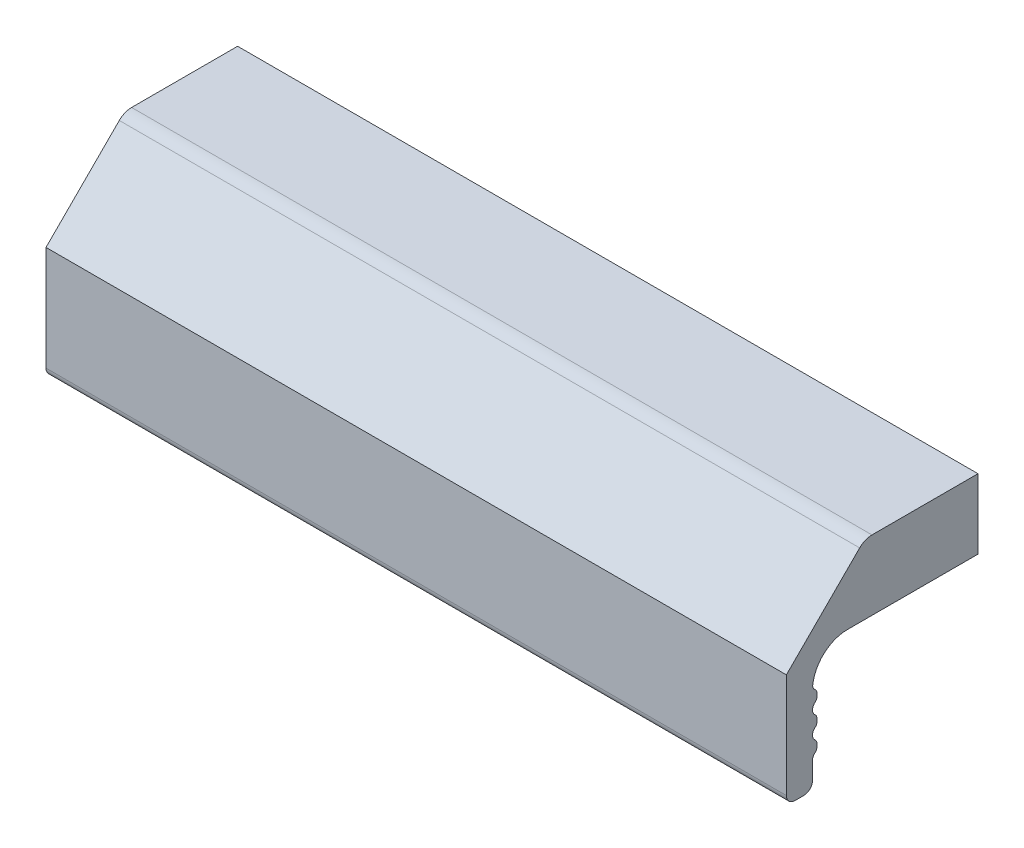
ISO-10303-21;
HEADER;
FILE_DESCRIPTION(('STEP AP214'),'2;1');
FILE_NAME('part.step','',(''),(''),'','','');
FILE_SCHEMA(('AUTOMOTIVE_DESIGN { 1 0 10303 214 1 1 1 1 }'));
ENDSEC;
DATA;
#1=APPLICATION_CONTEXT('core data for automotive mechanical design processes');
#2=APPLICATION_PROTOCOL_DEFINITION('international standard','automotive_design',2000,#1);
#3=PRODUCT_CONTEXT('',#1,'mechanical');
#4=PRODUCT('Part','Part','',(#3));
#5=PRODUCT_RELATED_PRODUCT_CATEGORY('part','',(#4));
#6=PRODUCT_DEFINITION_FORMATION('','',#4);
#7=PRODUCT_DEFINITION_CONTEXT('part definition',#1,'design');
#8=PRODUCT_DEFINITION('design','',#6,#7);
#9=PRODUCT_DEFINITION_SHAPE('','',#8);
#10=(LENGTH_UNIT() NAMED_UNIT(*) SI_UNIT(.MILLI.,.METRE.));
#11=(NAMED_UNIT(*) PLANE_ANGLE_UNIT() SI_UNIT($,.RADIAN.));
#12=(NAMED_UNIT(*) SI_UNIT($,.STERADIAN.) SOLID_ANGLE_UNIT());
#13=UNCERTAINTY_MEASURE_WITH_UNIT(LENGTH_MEASURE(1.E-05),#10,'distance_accuracy_value','');
#14=(GEOMETRIC_REPRESENTATION_CONTEXT(3) GLOBAL_UNCERTAINTY_ASSIGNED_CONTEXT((#13)) GLOBAL_UNIT_ASSIGNED_CONTEXT((#10,
#11,#12)) REPRESENTATION_CONTEXT('',''));
#15=CARTESIAN_POINT('',(0.,0.,0.));
#16=DIRECTION('',(0.,0.,1.));
#17=DIRECTION('',(1.,0.,0.));
#18=AXIS2_PLACEMENT_3D('',#15,#16,#17);
#19=CARTESIAN_POINT('',(77.5,-17.,22.));
#20=DIRECTION('',(0.,0.,1.));
#21=DIRECTION('',(1.,0.,0.));
#22=AXIS2_PLACEMENT_3D('',#19,#20,#21);
#23=PLANE('',#22);
#24=DIRECTION('',(-1.,0.,0.));
#25=VECTOR('',#24,1.);
#26=CARTESIAN_POINT('',(77.5,-17.,22.));
#27=LINE('',#26,#25);
#28=CARTESIAN_POINT('',(77.5,-17.,22.));
#29=VERTEX_POINT('',#28);
#30=CARTESIAN_POINT('',(-7.5,-17.,22.));
#31=VERTEX_POINT('',#30);
#32=EDGE_CURVE('E9',#29,#31,#27,.T.);
#33=ORIENTED_EDGE('',*,*,#32,.F.);
#34=DIRECTION('',(0.,1.,0.));
#35=VECTOR('',#34,1.);
#36=CARTESIAN_POINT('',(77.5,-17.,22.));
#37=LINE('',#36,#35);
#38=CARTESIAN_POINT('',(77.5,-5.,22.));
#39=VERTEX_POINT('',#38);
#40=EDGE_CURVE('E181',#29,#39,#37,.T.);
#41=ORIENTED_EDGE('',*,*,#40,.T.);
#42=DIRECTION('',(-1.,0.,0.));
#43=VECTOR('',#42,1.);
#44=CARTESIAN_POINT('',(77.5,-5.,22.));
#45=LINE('',#44,#43);
#46=CARTESIAN_POINT('',(-7.5,-5.,22.));
#47=VERTEX_POINT('',#46);
#48=EDGE_CURVE('E177',#39,#47,#45,.T.);
#49=ORIENTED_EDGE('',*,*,#48,.T.);
#50=DIRECTION('',(0.,1.,0.));
#51=VECTOR('',#50,1.);
#52=CARTESIAN_POINT('',(-7.5,-17.,22.));
#53=LINE('',#52,#51);
#54=EDGE_CURVE('E179',#31,#47,#53,.T.);
#55=ORIENTED_EDGE('',*,*,#54,.F.);
#56=EDGE_LOOP('',(#33,#41,#49,#55));
#57=FACE_BOUND('',#56,.T.);
#58=ADVANCED_FACE('F14',(#57),#23,.T.);
#59=CARTESIAN_POINT('',(77.5,-17.,21.));
#60=DIRECTION('',(-1.,0.,0.));
#61=DIRECTION('',(0.,0.,1.));
#62=AXIS2_PLACEMENT_3D('',#59,#60,#61);
#63=CYLINDRICAL_SURFACE('',#62,1.);
#64=DIRECTION('',(-1.,0.,0.));
#65=VECTOR('',#64,1.);
#66=CARTESIAN_POINT('',(77.5,-18.,21.));
#67=LINE('',#66,#65);
#68=CARTESIAN_POINT('',(77.5,-18.,21.));
#69=VERTEX_POINT('',#68);
#70=CARTESIAN_POINT('',(-7.5,-18.,21.));
#71=VERTEX_POINT('',#70);
#72=EDGE_CURVE('E22',#69,#71,#67,.T.);
#73=ORIENTED_EDGE('',*,*,#72,.F.);
#74=CARTESIAN_POINT('',(77.5,-17.,21.));
#75=DIRECTION('',(1.,0.,0.));
#76=DIRECTION('',(0.,0.,-1.));
#77=AXIS2_PLACEMENT_3D('',#74,#75,#76);
#78=CIRCLE('',#77,1.);
#79=EDGE_CURVE('E187',#29,#69,#78,.T.);
#80=ORIENTED_EDGE('',*,*,#79,.F.);
#81=ORIENTED_EDGE('',*,*,#32,.T.);
#82=CARTESIAN_POINT('',(-7.5,-17.,21.));
#83=DIRECTION('',(1.,0.,0.));
#84=DIRECTION('',(0.,0.,-1.));
#85=AXIS2_PLACEMENT_3D('',#82,#83,#84);
#86=CIRCLE('',#85,1.);
#87=EDGE_CURVE('E196',#31,#71,#86,.T.);
#88=ORIENTED_EDGE('',*,*,#87,.T.);
#89=EDGE_LOOP('',(#73,#80,#81,#88));
#90=FACE_BOUND('',#89,.T.);
#91=ADVANCED_FACE('F16',(#90),#63,.T.);
#92=CARTESIAN_POINT('',(77.5,-18.,20.));
#93=DIRECTION('',(0.,-1.,0.));
#94=DIRECTION('',(-1.,0.,0.));
#95=AXIS2_PLACEMENT_3D('',#92,#93,#94);
#96=PLANE('',#95);
#97=DIRECTION('',(-1.,0.,0.));
#98=VECTOR('',#97,1.);
#99=CARTESIAN_POINT('',(77.5,-18.,20.));
#100=LINE('',#99,#98);
#101=CARTESIAN_POINT('',(77.5,-18.,20.));
#102=VERTEX_POINT('',#101);
#103=CARTESIAN_POINT('',(-7.5,-18.,20.));
#104=VERTEX_POINT('',#103);
#105=EDGE_CURVE('E379',#102,#104,#100,.T.);
#106=ORIENTED_EDGE('',*,*,#105,.F.);
#107=DIRECTION('',(0.,0.,1.));
#108=VECTOR('',#107,1.);
#109=CARTESIAN_POINT('',(77.5,-18.,20.));
#110=LINE('',#109,#108);
#111=EDGE_CURVE('E334',#102,#69,#110,.T.);
#112=ORIENTED_EDGE('',*,*,#111,.T.);
#113=ORIENTED_EDGE('',*,*,#72,.T.);
#114=DIRECTION('',(0.,0.,1.));
#115=VECTOR('',#114,1.);
#116=CARTESIAN_POINT('',(-7.5,-18.,20.));
#117=LINE('',#116,#115);
#118=EDGE_CURVE('E265',#104,#71,#117,.T.);
#119=ORIENTED_EDGE('',*,*,#118,.F.);
#120=EDGE_LOOP('',(#106,#112,#113,#119));
#121=FACE_BOUND('',#120,.T.);
#122=ADVANCED_FACE('F382',(#121),#96,.T.);
#123=CARTESIAN_POINT('',(77.5,-17.,20.));
#124=DIRECTION('',(-1.,0.,0.));
#125=DIRECTION('',(0.,0.,1.));
#126=AXIS2_PLACEMENT_3D('',#123,#124,#125);
#127=CYLINDRICAL_SURFACE('',#126,1.);
#128=DIRECTION('',(-1.,0.,0.));
#129=VECTOR('',#128,1.);
#130=CARTESIAN_POINT('',(77.5,-17.,19.));
#131=LINE('',#130,#129);
#132=CARTESIAN_POINT('',(77.5,-17.,19.));
#133=VERTEX_POINT('',#132);
#134=CARTESIAN_POINT('',(-7.5,-17.,19.));
#135=VERTEX_POINT('',#134);
#136=EDGE_CURVE('E377',#133,#135,#131,.T.);
#137=ORIENTED_EDGE('',*,*,#136,.F.);
#138=CARTESIAN_POINT('',(77.5,-17.,20.));
#139=DIRECTION('',(1.,0.,0.));
#140=DIRECTION('',(0.,0.,-1.));
#141=AXIS2_PLACEMENT_3D('',#138,#139,#140);
#142=CIRCLE('',#141,1.);
#143=EDGE_CURVE('E331',#102,#133,#142,.T.);
#144=ORIENTED_EDGE('',*,*,#143,.F.);
#145=ORIENTED_EDGE('',*,*,#105,.T.);
#146=CARTESIAN_POINT('',(-7.5,-17.,20.));
#147=DIRECTION('',(1.,0.,0.));
#148=DIRECTION('',(0.,0.,-1.));
#149=AXIS2_PLACEMENT_3D('',#146,#147,#148);
#150=CIRCLE('',#149,1.);
#151=EDGE_CURVE('E262',#104,#135,#150,.T.);
#152=ORIENTED_EDGE('',*,*,#151,.T.);
#153=EDGE_LOOP('',(#137,#144,#145,#152));
#154=FACE_BOUND('',#153,.T.);
#155=ADVANCED_FACE('F468',(#154),#127,.T.);
#156=CARTESIAN_POINT('',(77.5,-17.,19.));
#157=DIRECTION('',(0.,-1.80411241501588E-13,1.));
#158=DIRECTION('',(0.,-1.,-1.80411241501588E-13));
#159=AXIS2_PLACEMENT_3D('',#156,#157,#158);
#160=PLANE('',#159);
#161=DIRECTION('',(-1.,0.,0.));
#162=VECTOR('',#161,1.);
#163=CARTESIAN_POINT('',(77.5,-15.,19.));
#164=LINE('',#163,#162);
#165=CARTESIAN_POINT('',(77.5,-15.,19.));
#166=VERTEX_POINT('',#165);
#167=CARTESIAN_POINT('',(-7.5,-15.,19.));
#168=VERTEX_POINT('',#167);
#169=EDGE_CURVE('E375',#166,#168,#164,.T.);
#170=ORIENTED_EDGE('',*,*,#169,.F.);
#171=DIRECTION('',(0.,1.,1.80411241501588E-13));
#172=VECTOR('',#171,1.);
#173=CARTESIAN_POINT('',(77.5,-17.,19.));
#174=LINE('',#173,#172);
#175=EDGE_CURVE('E328',#133,#166,#174,.T.);
#176=ORIENTED_EDGE('',*,*,#175,.F.);
#177=ORIENTED_EDGE('',*,*,#136,.T.);
#178=DIRECTION('',(0.,1.,1.80411241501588E-13));
#179=VECTOR('',#178,1.);
#180=CARTESIAN_POINT('',(-7.5,-17.,19.));
#181=LINE('',#180,#179);
#182=EDGE_CURVE('E259',#135,#168,#181,.T.);
#183=ORIENTED_EDGE('',*,*,#182,.T.);
#184=EDGE_LOOP('',(#170,#176,#177,#183));
#185=FACE_BOUND('',#184,.T.);
#186=ADVANCED_FACE('F464',(#185),#160,.F.);
#187=CARTESIAN_POINT('',(77.5,-15.,18.2));
#188=DIRECTION('',(-1.,0.,0.));
#189=DIRECTION('',(0.,0.,1.));
#190=AXIS2_PLACEMENT_3D('',#187,#188,#189);
#191=CYLINDRICAL_SURFACE('',#190,0.800000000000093);
#192=DIRECTION('',(-1.,0.,0.));
#193=VECTOR('',#192,1.);
#194=CARTESIAN_POINT('',(77.5,-14.3694184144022,18.6923076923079));
#195=LINE('',#194,#193);
#196=CARTESIAN_POINT('',(77.5,-14.3694184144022,18.6923076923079));
#197=VERTEX_POINT('',#196);
#198=CARTESIAN_POINT('',(-7.5,-14.3694184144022,18.6923076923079));
#199=VERTEX_POINT('',#198);
#200=EDGE_CURVE('E373',#197,#199,#195,.T.);
#201=ORIENTED_EDGE('',*,*,#200,.F.);
#202=CARTESIAN_POINT('',(77.5,-15.,18.2));
#203=DIRECTION('',(1.,0.,0.));
#204=DIRECTION('',(0.,0.,-1.));
#205=AXIS2_PLACEMENT_3D('',#202,#203,#204);
#206=CIRCLE('',#205,0.800000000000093);
#207=EDGE_CURVE('E325',#197,#166,#206,.T.);
#208=ORIENTED_EDGE('',*,*,#207,.T.);
#209=ORIENTED_EDGE('',*,*,#169,.T.);
#210=CARTESIAN_POINT('',(-7.5,-15.,18.2));
#211=DIRECTION('',(1.,0.,0.));
#212=DIRECTION('',(0.,0.,-1.));
#213=AXIS2_PLACEMENT_3D('',#210,#211,#212);
#214=CIRCLE('',#213,0.800000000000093);
#215=EDGE_CURVE('E256',#199,#168,#214,.T.);
#216=ORIENTED_EDGE('',*,*,#215,.F.);
#217=EDGE_LOOP('',(#201,#208,#209,#216));
#218=FACE_BOUND('',#217,.T.);
#219=ADVANCED_FACE('F462',(#218),#191,.F.);
#220=CARTESIAN_POINT('',(77.5,-13.9753049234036,19.));
#221=DIRECTION('',(-1.,0.,0.));
#222=DIRECTION('',(0.,0.,1.));
#223=AXIS2_PLACEMENT_3D('',#220,#221,#222);
#224=CYLINDRICAL_SURFACE('',#223,0.5);
#225=DIRECTION('',(-1.,0.,0.));
#226=VECTOR('',#225,1.);
#227=CARTESIAN_POINT('',(77.5,-13.9753049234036,18.5));
#228=LINE('',#227,#226);
#229=CARTESIAN_POINT('',(77.5,-13.9753049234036,18.5));
#230=VERTEX_POINT('',#229);
#231=CARTESIAN_POINT('',(-7.5,-13.9753049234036,18.5));
#232=VERTEX_POINT('',#231);
#233=EDGE_CURVE('E371',#230,#232,#228,.T.);
#234=ORIENTED_EDGE('',*,*,#233,.F.);
#235=CARTESIAN_POINT('',(77.5,-13.9753049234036,19.));
#236=DIRECTION('',(1.,0.,0.));
#237=DIRECTION('',(0.,0.,-1.));
#238=AXIS2_PLACEMENT_3D('',#235,#236,#237);
#239=CIRCLE('',#238,0.5);
#240=EDGE_CURVE('E322',#197,#230,#239,.T.);
#241=ORIENTED_EDGE('',*,*,#240,.F.);
#242=ORIENTED_EDGE('',*,*,#200,.T.);
#243=CARTESIAN_POINT('',(-7.5,-13.9753049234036,19.));
#244=DIRECTION('',(1.,0.,0.));
#245=DIRECTION('',(0.,0.,-1.));
#246=AXIS2_PLACEMENT_3D('',#243,#244,#245);
#247=CIRCLE('',#246,0.5);
#248=EDGE_CURVE('E253',#199,#232,#247,.T.);
#249=ORIENTED_EDGE('',*,*,#248,.T.);
#250=EDGE_LOOP('',(#234,#241,#242,#249));
#251=FACE_BOUND('',#250,.T.);
#252=ADVANCED_FACE('F458',(#251),#224,.T.);
#253=CARTESIAN_POINT('',(77.5,-13.9753049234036,18.5));
#254=DIRECTION('',(0.,0.,1.));
#255=DIRECTION('',(1.,0.,0.));
#256=AXIS2_PLACEMENT_3D('',#253,#254,#255);
#257=PLANE('',#256);
#258=DIRECTION('',(-1.,0.,0.));
#259=VECTOR('',#258,1.);
#260=CARTESIAN_POINT('',(77.5,-13.5246950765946,18.5));
#261=LINE('',#260,#259);
#262=CARTESIAN_POINT('',(77.5,-13.5246950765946,18.5));
#263=VERTEX_POINT('',#262);
#264=CARTESIAN_POINT('',(-7.5,-13.5246950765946,18.5));
#265=VERTEX_POINT('',#264);
#266=EDGE_CURVE('E369',#263,#265,#261,.T.);
#267=ORIENTED_EDGE('',*,*,#266,.F.);
#268=DIRECTION('',(0.,1.,0.));
#269=VECTOR('',#268,1.);
#270=CARTESIAN_POINT('',(77.5,-13.9753049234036,18.5));
#271=LINE('',#270,#269);
#272=EDGE_CURVE('E319',#230,#263,#271,.T.);
#273=ORIENTED_EDGE('',*,*,#272,.F.);
#274=ORIENTED_EDGE('',*,*,#233,.T.);
#275=DIRECTION('',(0.,1.,0.));
#276=VECTOR('',#275,1.);
#277=CARTESIAN_POINT('',(-7.5,-13.9753049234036,18.5));
#278=LINE('',#277,#276);
#279=EDGE_CURVE('E250',#232,#265,#278,.T.);
#280=ORIENTED_EDGE('',*,*,#279,.T.);
#281=EDGE_LOOP('',(#267,#273,#274,#280));
#282=FACE_BOUND('',#281,.T.);
#283=ADVANCED_FACE('F454',(#282),#257,.F.);
#284=CARTESIAN_POINT('',(77.5,-13.5246950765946,19.));
#285=DIRECTION('',(-1.,0.,0.));
#286=DIRECTION('',(0.,0.,1.));
#287=AXIS2_PLACEMENT_3D('',#284,#285,#286);
#288=CYLINDRICAL_SURFACE('',#287,0.499999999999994);
#289=DIRECTION('',(-1.,0.,0.));
#290=VECTOR('',#289,1.);
#291=CARTESIAN_POINT('',(77.5,-13.1305815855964,18.6923076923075));
#292=LINE('',#291,#290);
#293=CARTESIAN_POINT('',(77.5,-13.1305815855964,18.6923076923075));
#294=VERTEX_POINT('',#293);
#295=CARTESIAN_POINT('',(-7.5,-13.1305815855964,18.6923076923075));
#296=VERTEX_POINT('',#295);
#297=EDGE_CURVE('E367',#294,#296,#292,.T.);
#298=ORIENTED_EDGE('',*,*,#297,.F.);
#299=CARTESIAN_POINT('',(77.5,-13.5246950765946,19.));
#300=DIRECTION('',(1.,0.,0.));
#301=DIRECTION('',(0.,0.,-1.));
#302=AXIS2_PLACEMENT_3D('',#299,#300,#301);
#303=CIRCLE('',#302,0.499999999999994);
#304=EDGE_CURVE('E316',#263,#294,#303,.T.);
#305=ORIENTED_EDGE('',*,*,#304,.F.);
#306=ORIENTED_EDGE('',*,*,#266,.T.);
#307=CARTESIAN_POINT('',(-7.5,-13.5246950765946,19.));
#308=DIRECTION('',(1.,0.,0.));
#309=DIRECTION('',(0.,0.,-1.));
#310=AXIS2_PLACEMENT_3D('',#307,#308,#309);
#311=CIRCLE('',#310,0.499999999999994);
#312=EDGE_CURVE('E247',#265,#296,#311,.T.);
#313=ORIENTED_EDGE('',*,*,#312,.T.);
#314=EDGE_LOOP('',(#298,#305,#306,#313));
#315=FACE_BOUND('',#314,.T.);
#316=ADVANCED_FACE('F450',(#315),#288,.T.);
#317=CARTESIAN_POINT('',(77.5,-12.5,18.2));
#318=DIRECTION('',(-1.,0.,0.));
#319=DIRECTION('',(0.,0.,1.));
#320=AXIS2_PLACEMENT_3D('',#317,#318,#319);
#321=CYLINDRICAL_SURFACE('',#320,0.799999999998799);
#322=DIRECTION('',(-1.,0.,0.));
#323=VECTOR('',#322,1.);
#324=CARTESIAN_POINT('',(77.5,-11.8694184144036,18.6923076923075));
#325=LINE('',#324,#323);
#326=CARTESIAN_POINT('',(77.5,-11.8694184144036,18.6923076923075));
#327=VERTEX_POINT('',#326);
#328=CARTESIAN_POINT('',(-7.5,-11.8694184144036,18.6923076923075));
#329=VERTEX_POINT('',#328);
#330=EDGE_CURVE('E365',#327,#329,#325,.T.);
#331=ORIENTED_EDGE('',*,*,#330,.F.);
#332=CARTESIAN_POINT('',(77.5,-12.5,18.2));
#333=DIRECTION('',(1.,0.,0.));
#334=DIRECTION('',(0.,0.,-1.));
#335=AXIS2_PLACEMENT_3D('',#332,#333,#334);
#336=CIRCLE('',#335,0.799999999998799);
#337=EDGE_CURVE('E313',#327,#294,#336,.T.);
#338=ORIENTED_EDGE('',*,*,#337,.T.);
#339=ORIENTED_EDGE('',*,*,#297,.T.);
#340=CARTESIAN_POINT('',(-7.5,-12.5,18.2));
#341=DIRECTION('',(1.,0.,0.));
#342=DIRECTION('',(0.,0.,-1.));
#343=AXIS2_PLACEMENT_3D('',#340,#341,#342);
#344=CIRCLE('',#343,0.799999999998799);
#345=EDGE_CURVE('E244',#329,#296,#344,.T.);
#346=ORIENTED_EDGE('',*,*,#345,.F.);
#347=EDGE_LOOP('',(#331,#338,#339,#346));
#348=FACE_BOUND('',#347,.T.);
#349=ADVANCED_FACE('F446',(#348),#321,.F.);
#350=CARTESIAN_POINT('',(77.5,-11.4753049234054,19.));
#351=DIRECTION('',(-1.,0.,0.));
#352=DIRECTION('',(0.,0.,1.));
#353=AXIS2_PLACEMENT_3D('',#350,#351,#352);
#354=CYLINDRICAL_SURFACE('',#353,0.5);
#355=DIRECTION('',(-1.,0.,0.));
#356=VECTOR('',#355,1.);
#357=CARTESIAN_POINT('',(77.5,-11.4753049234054,18.5));
#358=LINE('',#357,#356);
#359=CARTESIAN_POINT('',(77.5,-11.4753049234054,18.5));
#360=VERTEX_POINT('',#359);
#361=CARTESIAN_POINT('',(-7.5,-11.4753049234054,18.5));
#362=VERTEX_POINT('',#361);
#363=EDGE_CURVE('E363',#360,#362,#358,.T.);
#364=ORIENTED_EDGE('',*,*,#363,.F.);
#365=CARTESIAN_POINT('',(77.5,-11.4753049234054,19.));
#366=DIRECTION('',(1.,0.,0.));
#367=DIRECTION('',(0.,0.,-1.));
#368=AXIS2_PLACEMENT_3D('',#365,#366,#367);
#369=CIRCLE('',#368,0.5);
#370=EDGE_CURVE('E310',#327,#360,#369,.T.);
#371=ORIENTED_EDGE('',*,*,#370,.F.);
#372=ORIENTED_EDGE('',*,*,#330,.T.);
#373=CARTESIAN_POINT('',(-7.5,-11.4753049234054,19.));
#374=DIRECTION('',(1.,0.,0.));
#375=DIRECTION('',(0.,0.,-1.));
#376=AXIS2_PLACEMENT_3D('',#373,#374,#375);
#377=CIRCLE('',#376,0.5);
#378=EDGE_CURVE('E241',#329,#362,#377,.T.);
#379=ORIENTED_EDGE('',*,*,#378,.T.);
#380=EDGE_LOOP('',(#364,#371,#372,#379));
#381=FACE_BOUND('',#380,.T.);
#382=ADVANCED_FACE('F442',(#381),#354,.T.);
#383=CARTESIAN_POINT('',(77.5,-11.4753049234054,18.5));
#384=DIRECTION('',(0.,0.,1.));
#385=DIRECTION('',(1.,0.,0.));
#386=AXIS2_PLACEMENT_3D('',#383,#384,#385);
#387=PLANE('',#386);
#388=DIRECTION('',(-1.,0.,0.));
#389=VECTOR('',#388,1.);
#390=CARTESIAN_POINT('',(77.5,-11.0246950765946,18.5));
#391=LINE('',#390,#389);
#392=CARTESIAN_POINT('',(77.5,-11.0246950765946,18.5));
#393=VERTEX_POINT('',#392);
#394=CARTESIAN_POINT('',(-7.5,-11.0246950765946,18.5));
#395=VERTEX_POINT('',#394);
#396=EDGE_CURVE('E361',#393,#395,#391,.T.);
#397=ORIENTED_EDGE('',*,*,#396,.F.);
#398=DIRECTION('',(0.,1.,0.));
#399=VECTOR('',#398,1.);
#400=CARTESIAN_POINT('',(77.5,-11.4753049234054,18.5));
#401=LINE('',#400,#399);
#402=EDGE_CURVE('E307',#360,#393,#401,.T.);
#403=ORIENTED_EDGE('',*,*,#402,.F.);
#404=ORIENTED_EDGE('',*,*,#363,.T.);
#405=DIRECTION('',(0.,1.,0.));
#406=VECTOR('',#405,1.);
#407=CARTESIAN_POINT('',(-7.5,-11.4753049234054,18.5));
#408=LINE('',#407,#406);
#409=EDGE_CURVE('E238',#362,#395,#408,.T.);
#410=ORIENTED_EDGE('',*,*,#409,.T.);
#411=EDGE_LOOP('',(#397,#403,#404,#410));
#412=FACE_BOUND('',#411,.T.);
#413=ADVANCED_FACE('F438',(#412),#387,.F.);
#414=CARTESIAN_POINT('',(77.5,-11.0246950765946,19.));
#415=DIRECTION('',(-1.,0.,0.));
#416=DIRECTION('',(0.,0.,1.));
#417=AXIS2_PLACEMENT_3D('',#414,#415,#416);
#418=CYLINDRICAL_SURFACE('',#417,0.499999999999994);
#419=DIRECTION('',(-1.,0.,0.));
#420=VECTOR('',#419,1.);
#421=CARTESIAN_POINT('',(77.5,-10.630581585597,18.692307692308));
#422=LINE('',#421,#420);
#423=CARTESIAN_POINT('',(77.5,-10.630581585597,18.692307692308));
#424=VERTEX_POINT('',#423);
#425=CARTESIAN_POINT('',(-7.5,-10.630581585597,18.692307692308));
#426=VERTEX_POINT('',#425);
#427=EDGE_CURVE('E359',#424,#426,#422,.T.);
#428=ORIENTED_EDGE('',*,*,#427,.F.);
#429=CARTESIAN_POINT('',(77.5,-11.0246950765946,19.));
#430=DIRECTION('',(1.,0.,0.));
#431=DIRECTION('',(0.,0.,-1.));
#432=AXIS2_PLACEMENT_3D('',#429,#430,#431);
#433=CIRCLE('',#432,0.499999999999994);
#434=EDGE_CURVE('E304',#393,#424,#433,.T.);
#435=ORIENTED_EDGE('',*,*,#434,.F.);
#436=ORIENTED_EDGE('',*,*,#396,.T.);
#437=CARTESIAN_POINT('',(-7.5,-11.0246950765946,19.));
#438=DIRECTION('',(1.,0.,0.));
#439=DIRECTION('',(0.,0.,-1.));
#440=AXIS2_PLACEMENT_3D('',#437,#438,#439);
#441=CIRCLE('',#440,0.499999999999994);
#442=EDGE_CURVE('E235',#395,#426,#441,.T.);
#443=ORIENTED_EDGE('',*,*,#442,.T.);
#444=EDGE_LOOP('',(#428,#435,#436,#443));
#445=FACE_BOUND('',#444,.T.);
#446=ADVANCED_FACE('F434',(#445),#418,.T.);
#447=CARTESIAN_POINT('',(77.5,-10.,18.2));
#448=DIRECTION('',(-1.,0.,0.));
#449=DIRECTION('',(0.,0.,1.));
#450=AXIS2_PLACEMENT_3D('',#447,#448,#449);
#451=CYLINDRICAL_SURFACE('',#450,0.799999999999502);
#452=DIRECTION('',(-1.,0.,0.));
#453=VECTOR('',#452,1.);
#454=CARTESIAN_POINT('',(77.5,-9.36941841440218,18.6923076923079));
#455=LINE('',#454,#453);
#456=CARTESIAN_POINT('',(77.5,-9.36941841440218,18.6923076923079));
#457=VERTEX_POINT('',#456);
#458=CARTESIAN_POINT('',(-7.5,-9.36941841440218,18.6923076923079));
#459=VERTEX_POINT('',#458);
#460=EDGE_CURVE('E357',#457,#459,#455,.T.);
#461=ORIENTED_EDGE('',*,*,#460,.F.);
#462=CARTESIAN_POINT('',(77.5,-10.,18.2));
#463=DIRECTION('',(1.,0.,0.));
#464=DIRECTION('',(0.,0.,-1.));
#465=AXIS2_PLACEMENT_3D('',#462,#463,#464);
#466=CIRCLE('',#465,0.799999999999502);
#467=EDGE_CURVE('E301',#457,#424,#466,.T.);
#468=ORIENTED_EDGE('',*,*,#467,.T.);
#469=ORIENTED_EDGE('',*,*,#427,.T.);
#470=CARTESIAN_POINT('',(-7.5,-10.,18.2));
#471=DIRECTION('',(1.,0.,0.));
#472=DIRECTION('',(0.,0.,-1.));
#473=AXIS2_PLACEMENT_3D('',#470,#471,#472);
#474=CIRCLE('',#473,0.799999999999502);
#475=EDGE_CURVE('E232',#459,#426,#474,.T.);
#476=ORIENTED_EDGE('',*,*,#475,.F.);
#477=EDGE_LOOP('',(#461,#468,#469,#476));
#478=FACE_BOUND('',#477,.T.);
#479=ADVANCED_FACE('F430',(#478),#451,.F.);
#480=CARTESIAN_POINT('',(77.5,-8.97530492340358,19.));
#481=DIRECTION('',(-1.,0.,0.));
#482=DIRECTION('',(0.,0.,1.));
#483=AXIS2_PLACEMENT_3D('',#480,#481,#482);
#484=CYLINDRICAL_SURFACE('',#483,0.5);
#485=DIRECTION('',(-1.,0.,0.));
#486=VECTOR('',#485,1.);
#487=CARTESIAN_POINT('',(77.5,-8.97530492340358,18.5));
#488=LINE('',#487,#486);
#489=CARTESIAN_POINT('',(77.5,-8.97530492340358,18.5));
#490=VERTEX_POINT('',#489);
#491=CARTESIAN_POINT('',(-7.5,-8.97530492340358,18.5));
#492=VERTEX_POINT('',#491);
#493=EDGE_CURVE('E355',#490,#492,#488,.T.);
#494=ORIENTED_EDGE('',*,*,#493,.F.);
#495=CARTESIAN_POINT('',(77.5,-8.97530492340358,19.));
#496=DIRECTION('',(1.,0.,0.));
#497=DIRECTION('',(0.,0.,-1.));
#498=AXIS2_PLACEMENT_3D('',#495,#496,#497);
#499=CIRCLE('',#498,0.5);
#500=EDGE_CURVE('E298',#457,#490,#499,.T.);
#501=ORIENTED_EDGE('',*,*,#500,.F.);
#502=ORIENTED_EDGE('',*,*,#460,.T.);
#503=CARTESIAN_POINT('',(-7.5,-8.97530492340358,19.));
#504=DIRECTION('',(1.,0.,0.));
#505=DIRECTION('',(0.,0.,-1.));
#506=AXIS2_PLACEMENT_3D('',#503,#504,#505);
#507=CIRCLE('',#506,0.5);
#508=EDGE_CURVE('E229',#459,#492,#507,.T.);
#509=ORIENTED_EDGE('',*,*,#508,.T.);
#510=EDGE_LOOP('',(#494,#501,#502,#509));
#511=FACE_BOUND('',#510,.T.);
#512=ADVANCED_FACE('F426',(#511),#484,.T.);
#513=CARTESIAN_POINT('',(77.5,-8.97530492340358,18.5));
#514=DIRECTION('',(0.,0.,1.));
#515=DIRECTION('',(1.,0.,0.));
#516=AXIS2_PLACEMENT_3D('',#513,#514,#515);
#517=PLANE('',#516);
#518=DIRECTION('',(-1.,0.,0.));
#519=VECTOR('',#518,1.);
#520=CARTESIAN_POINT('',(77.5,-8.52469507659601,18.5));
#521=LINE('',#520,#519);
#522=CARTESIAN_POINT('',(77.5,-8.52469507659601,18.5));
#523=VERTEX_POINT('',#522);
#524=CARTESIAN_POINT('',(-7.5,-8.52469507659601,18.5));
#525=VERTEX_POINT('',#524);
#526=EDGE_CURVE('E353',#523,#525,#521,.T.);
#527=ORIENTED_EDGE('',*,*,#526,.F.);
#528=DIRECTION('',(0.,1.,0.));
#529=VECTOR('',#528,1.);
#530=CARTESIAN_POINT('',(77.5,-8.97530492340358,18.5));
#531=LINE('',#530,#529);
#532=EDGE_CURVE('E295',#490,#523,#531,.T.);
#533=ORIENTED_EDGE('',*,*,#532,.F.);
#534=ORIENTED_EDGE('',*,*,#493,.T.);
#535=DIRECTION('',(0.,1.,0.));
#536=VECTOR('',#535,1.);
#537=CARTESIAN_POINT('',(-7.5,-8.97530492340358,18.5));
#538=LINE('',#537,#536);
#539=EDGE_CURVE('E226',#492,#525,#538,.T.);
#540=ORIENTED_EDGE('',*,*,#539,.T.);
#541=EDGE_LOOP('',(#527,#533,#534,#540));
#542=FACE_BOUND('',#541,.T.);
#543=ADVANCED_FACE('F422',(#542),#517,.F.);
#544=CARTESIAN_POINT('',(77.5,-8.52469507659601,19.));
#545=DIRECTION('',(-1.,0.,0.));
#546=DIRECTION('',(0.,0.,1.));
#547=AXIS2_PLACEMENT_3D('',#544,#545,#546);
#548=CYLINDRICAL_SURFACE('',#547,0.5);
#549=DIRECTION('',(-1.,0.,0.));
#550=VECTOR('',#549,1.);
#551=CARTESIAN_POINT('',(77.5,-8.1305815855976,18.6923076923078));
#552=LINE('',#551,#550);
#553=CARTESIAN_POINT('',(77.5,-8.1305815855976,18.6923076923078));
#554=VERTEX_POINT('',#553);
#555=CARTESIAN_POINT('',(-7.5,-8.1305815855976,18.6923076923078));
#556=VERTEX_POINT('',#555);
#557=EDGE_CURVE('E351',#554,#556,#552,.T.);
#558=ORIENTED_EDGE('',*,*,#557,.F.);
#559=CARTESIAN_POINT('',(77.5,-8.52469507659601,19.));
#560=DIRECTION('',(1.,0.,0.));
#561=DIRECTION('',(0.,0.,-1.));
#562=AXIS2_PLACEMENT_3D('',#559,#560,#561);
#563=CIRCLE('',#562,0.5);
#564=EDGE_CURVE('E292',#523,#554,#563,.T.);
#565=ORIENTED_EDGE('',*,*,#564,.F.);
#566=ORIENTED_EDGE('',*,*,#526,.T.);
#567=CARTESIAN_POINT('',(-7.5,-8.52469507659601,19.));
#568=DIRECTION('',(1.,0.,0.));
#569=DIRECTION('',(0.,0.,-1.));
#570=AXIS2_PLACEMENT_3D('',#567,#568,#569);
#571=CIRCLE('',#570,0.5);
#572=EDGE_CURVE('E223',#525,#556,#571,.T.);
#573=ORIENTED_EDGE('',*,*,#572,.T.);
#574=EDGE_LOOP('',(#558,#565,#566,#573));
#575=FACE_BOUND('',#574,.T.);
#576=ADVANCED_FACE('F418',(#575),#548,.T.);
#577=CARTESIAN_POINT('',(77.5,-7.5,18.2));
#578=DIRECTION('',(-1.,0.,0.));
#579=DIRECTION('',(0.,0.,1.));
#580=AXIS2_PLACEMENT_3D('',#577,#578,#579);
#581=CYLINDRICAL_SURFACE('',#580,0.799999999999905);
#582=DIRECTION('',(-1.,0.,0.));
#583=VECTOR('',#582,1.);
#584=CARTESIAN_POINT('',(77.5,-7.7980536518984,18.9424042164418));
#585=LINE('',#584,#583);
#586=CARTESIAN_POINT('',(77.5,-7.7980536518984,18.9424042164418));
#587=VERTEX_POINT('',#586);
#588=CARTESIAN_POINT('',(-7.5,-7.7980536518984,18.9424042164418));
#589=VERTEX_POINT('',#588);
#590=EDGE_CURVE('E349',#587,#589,#585,.T.);
#591=ORIENTED_EDGE('',*,*,#590,.F.);
#592=CARTESIAN_POINT('',(77.5,-7.5,18.2));
#593=DIRECTION('',(1.,0.,0.));
#594=DIRECTION('',(0.,0.,-1.));
#595=AXIS2_PLACEMENT_3D('',#592,#593,#594);
#596=CIRCLE('',#595,0.799999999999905);
#597=EDGE_CURVE('E289',#587,#554,#596,.T.);
#598=ORIENTED_EDGE('',*,*,#597,.T.);
#599=ORIENTED_EDGE('',*,*,#557,.T.);
#600=CARTESIAN_POINT('',(-7.5,-7.5,18.2));
#601=DIRECTION('',(1.,0.,0.));
#602=DIRECTION('',(0.,0.,-1.));
#603=AXIS2_PLACEMENT_3D('',#600,#601,#602);
#604=CIRCLE('',#603,0.799999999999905);
#605=EDGE_CURVE('E220',#589,#556,#604,.T.);
#606=ORIENTED_EDGE('',*,*,#605,.F.);
#607=EDGE_LOOP('',(#591,#598,#599,#606));
#608=FACE_BOUND('',#607,.T.);
#609=ADVANCED_FACE('F414',(#608),#581,.F.);
#610=CARTESIAN_POINT('',(77.5,-7.61177011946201,18.4784015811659));
#611=DIRECTION('',(-1.,0.,0.));
#612=DIRECTION('',(0.,0.,1.));
#613=AXIS2_PLACEMENT_3D('',#610,#611,#612);
#614=CYLINDRICAL_SURFACE('',#613,0.5);
#615=DIRECTION('',(-1.,0.,0.));
#616=VECTOR('',#615,1.);
#617=CARTESIAN_POINT('',(77.5,-7.55630870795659,18.975316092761));
#618=LINE('',#617,#616);
#619=CARTESIAN_POINT('',(77.5,-7.55630870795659,18.975316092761));
#620=VERTEX_POINT('',#619);
#621=CARTESIAN_POINT('',(-7.5,-7.55630870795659,18.975316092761));
#622=VERTEX_POINT('',#621);
#623=EDGE_CURVE('E347',#620,#622,#618,.T.);
#624=ORIENTED_EDGE('',*,*,#623,.F.);
#625=CARTESIAN_POINT('',(77.5,-7.61177011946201,18.4784015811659));
#626=DIRECTION('',(1.,0.,0.));
#627=DIRECTION('',(0.,0.,-1.));
#628=AXIS2_PLACEMENT_3D('',#625,#626,#627);
#629=CIRCLE('',#628,0.5);
#630=EDGE_CURVE('E286',#620,#587,#629,.T.);
#631=ORIENTED_EDGE('',*,*,#630,.T.);
#632=ORIENTED_EDGE('',*,*,#590,.T.);
#633=CARTESIAN_POINT('',(-7.5,-7.61177011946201,18.4784015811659));
#634=DIRECTION('',(1.,0.,0.));
#635=DIRECTION('',(0.,0.,-1.));
#636=AXIS2_PLACEMENT_3D('',#633,#634,#635);
#637=CIRCLE('',#636,0.5);
#638=EDGE_CURVE('E217',#622,#589,#637,.T.);
#639=ORIENTED_EDGE('',*,*,#638,.F.);
#640=EDGE_LOOP('',(#624,#631,#632,#639));
#641=FACE_BOUND('',#640,.T.);
#642=ADVANCED_FACE('F411',(#641),#614,.F.);
#643=CARTESIAN_POINT('',(77.5,-8.,15.));
#644=DIRECTION('',(-1.,0.,0.));
#645=DIRECTION('',(0.,0.,1.));
#646=AXIS2_PLACEMENT_3D('',#643,#644,#645);
#647=CYLINDRICAL_SURFACE('',#646,4.);
#648=DIRECTION('',(-1.,0.,0.));
#649=VECTOR('',#648,1.);
#650=CARTESIAN_POINT('',(77.5,-4.,15.));
#651=LINE('',#650,#649);
#652=CARTESIAN_POINT('',(77.5,-4.,15.));
#653=VERTEX_POINT('',#652);
#654=CARTESIAN_POINT('',(-7.5,-4.,15.));
#655=VERTEX_POINT('',#654);
#656=EDGE_CURVE('E345',#653,#655,#651,.T.);
#657=ORIENTED_EDGE('',*,*,#656,.F.);
#658=CARTESIAN_POINT('',(77.5,-8.,15.));
#659=DIRECTION('',(1.,0.,0.));
#660=DIRECTION('',(0.,0.,-1.));
#661=AXIS2_PLACEMENT_3D('',#658,#659,#660);
#662=CIRCLE('',#661,4.);
#663=EDGE_CURVE('E283',#653,#620,#662,.T.);
#664=ORIENTED_EDGE('',*,*,#663,.T.);
#665=ORIENTED_EDGE('',*,*,#623,.T.);
#666=CARTESIAN_POINT('',(-7.5,-8.,15.));
#667=DIRECTION('',(1.,0.,0.));
#668=DIRECTION('',(0.,0.,-1.));
#669=AXIS2_PLACEMENT_3D('',#666,#667,#668);
#670=CIRCLE('',#669,4.);
#671=EDGE_CURVE('E214',#655,#622,#670,.T.);
#672=ORIENTED_EDGE('',*,*,#671,.F.);
#673=EDGE_LOOP('',(#657,#664,#665,#672));
#674=FACE_BOUND('',#673,.T.);
#675=ADVANCED_FACE('F406',(#674),#647,.F.);
#676=CARTESIAN_POINT('',(77.5,-4.,0.));
#677=DIRECTION('',(0.,-1.,0.));
#678=DIRECTION('',(-1.,0.,0.));
#679=AXIS2_PLACEMENT_3D('',#676,#677,#678);
#680=PLANE('',#679);
#681=DIRECTION('',(-1.,0.,0.));
#682=VECTOR('',#681,1.);
#683=CARTESIAN_POINT('',(77.5,-4.,0.));
#684=LINE('',#683,#682);
#685=CARTESIAN_POINT('',(77.5,-4.,0.));
#686=VERTEX_POINT('',#685);
#687=CARTESIAN_POINT('',(-7.5,-4.,0.));
#688=VERTEX_POINT('',#687);
#689=EDGE_CURVE('E343',#686,#688,#684,.T.);
#690=ORIENTED_EDGE('',*,*,#689,.F.);
#691=DIRECTION('',(0.,0.,1.));
#692=VECTOR('',#691,1.);
#693=CARTESIAN_POINT('',(77.5,-4.,0.));
#694=LINE('',#693,#692);
#695=EDGE_CURVE('E280',#686,#653,#694,.T.);
#696=ORIENTED_EDGE('',*,*,#695,.T.);
#697=ORIENTED_EDGE('',*,*,#656,.T.);
#698=DIRECTION('',(0.,0.,1.));
#699=VECTOR('',#698,1.);
#700=CARTESIAN_POINT('',(-7.5,-4.,0.));
#701=LINE('',#700,#699);
#702=EDGE_CURVE('E211',#688,#655,#701,.T.);
#703=ORIENTED_EDGE('',*,*,#702,.F.);
#704=EDGE_LOOP('',(#690,#696,#697,#703));
#705=FACE_BOUND('',#704,.T.);
#706=ADVANCED_FACE('F403',(#705),#680,.T.);
#707=CARTESIAN_POINT('',(77.5,4.,0.));
#708=DIRECTION('',(0.,0.,-1.));
#709=DIRECTION('',(-1.,0.,0.));
#710=AXIS2_PLACEMENT_3D('',#707,#708,#709);
#711=PLANE('',#710);
#712=CARTESIAN_POINT('',(0.,0.,0.));
#713=DIRECTION('',(0.,0.,-1.));
#714=DIRECTION('',(-1.,0.,0.));
#715=AXIS2_PLACEMENT_3D('',#712,#713,#714);
#716=CIRCLE('',#715,2.);
#717=CARTESIAN_POINT('',(-2.,0.,0.));
#718=VERTEX_POINT('',#717);
#719=EDGE_CURVE('E736',#718,#718,#716,.T.);
#720=ORIENTED_EDGE('',*,*,#719,.F.);
#721=EDGE_LOOP('',(#720));
#722=FACE_BOUND('',#721,.T.);
#723=CARTESIAN_POINT('',(70.,0.,0.));
#724=DIRECTION('',(0.,0.,-1.));
#725=DIRECTION('',(-1.,0.,0.));
#726=AXIS2_PLACEMENT_3D('',#723,#724,#725);
#727=CIRCLE('',#726,2.);
#728=CARTESIAN_POINT('',(68.,0.,0.));
#729=VERTEX_POINT('',#728);
#730=EDGE_CURVE('E735',#729,#729,#727,.T.);
#731=ORIENTED_EDGE('',*,*,#730,.F.);
#732=EDGE_LOOP('',(#731));
#733=FACE_BOUND('',#732,.T.);
#734=DIRECTION('',(-1.,0.,0.));
#735=VECTOR('',#734,1.);
#736=CARTESIAN_POINT('',(77.5,4.,0.));
#737=LINE('',#736,#735);
#738=CARTESIAN_POINT('',(77.5,4.,0.));
#739=VERTEX_POINT('',#738);
#740=CARTESIAN_POINT('',(-7.5,4.,0.));
#741=VERTEX_POINT('',#740);
#742=EDGE_CURVE('E341',#739,#741,#737,.T.);
#743=ORIENTED_EDGE('',*,*,#742,.F.);
#744=DIRECTION('',(0.,-1.,0.));
#745=VECTOR('',#744,1.);
#746=CARTESIAN_POINT('',(77.5,4.,0.));
#747=LINE('',#746,#745);
#748=EDGE_CURVE('E277',#739,#686,#747,.T.);
#749=ORIENTED_EDGE('',*,*,#748,.T.);
#750=ORIENTED_EDGE('',*,*,#689,.T.);
#751=DIRECTION('',(0.,-1.,0.));
#752=VECTOR('',#751,1.);
#753=CARTESIAN_POINT('',(-7.5,4.,0.));
#754=LINE('',#753,#752);
#755=EDGE_CURVE('E208',#741,#688,#754,.T.);
#756=ORIENTED_EDGE('',*,*,#755,.F.);
#757=EDGE_LOOP('',(#743,#749,#750,#756));
#758=FACE_BOUND('',#757,.T.);
#759=ADVANCED_FACE('F398',(#722,#733,#758),#711,.T.);
#760=CARTESIAN_POINT('',(77.5,4.,12.1715728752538));
#761=DIRECTION('',(0.,1.,0.));
#762=DIRECTION('',(1.,0.,0.));
#763=AXIS2_PLACEMENT_3D('',#760,#761,#762);
#764=PLANE('',#763);
#765=DIRECTION('',(-1.,0.,0.));
#766=VECTOR('',#765,1.);
#767=CARTESIAN_POINT('',(77.5,4.,12.1715728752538));
#768=LINE('',#767,#766);
#769=CARTESIAN_POINT('',(77.5,4.,12.1715728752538));
#770=VERTEX_POINT('',#769);
#771=CARTESIAN_POINT('',(-7.5,4.,12.1715728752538));
#772=VERTEX_POINT('',#771);
#773=EDGE_CURVE('E339',#770,#772,#768,.T.);
#774=ORIENTED_EDGE('',*,*,#773,.F.);
#775=DIRECTION('',(0.,0.,-1.));
#776=VECTOR('',#775,1.);
#777=CARTESIAN_POINT('',(77.5,4.,12.1715728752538));
#778=LINE('',#777,#776);
#779=EDGE_CURVE('E274',#770,#739,#778,.T.);
#780=ORIENTED_EDGE('',*,*,#779,.T.);
#781=ORIENTED_EDGE('',*,*,#742,.T.);
#782=DIRECTION('',(0.,0.,-1.));
#783=VECTOR('',#782,1.);
#784=CARTESIAN_POINT('',(-7.5,4.,12.1715728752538));
#785=LINE('',#784,#783);
#786=EDGE_CURVE('E202',#772,#741,#785,.T.);
#787=ORIENTED_EDGE('',*,*,#786,.F.);
#788=EDGE_LOOP('',(#774,#780,#781,#787));
#789=FACE_BOUND('',#788,.T.);
#790=ADVANCED_FACE('F396',(#789),#764,.T.);
#791=CARTESIAN_POINT('',(77.5,2.,12.1715728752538));
#792=DIRECTION('',(-1.,0.,0.));
#793=DIRECTION('',(0.,0.,1.));
#794=AXIS2_PLACEMENT_3D('',#791,#792,#793);
#795=CYLINDRICAL_SURFACE('',#794,2.);
#796=DIRECTION('',(-1.,0.,0.));
#797=VECTOR('',#796,1.);
#798=CARTESIAN_POINT('',(77.5,3.41421356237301,13.5857864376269));
#799=LINE('',#798,#797);
#800=CARTESIAN_POINT('',(77.5,3.41421356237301,13.5857864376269));
#801=VERTEX_POINT('',#800);
#802=CARTESIAN_POINT('',(-7.5,3.41421356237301,13.5857864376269));
#803=VERTEX_POINT('',#802);
#804=EDGE_CURVE('E186',#801,#803,#799,.T.);
#805=ORIENTED_EDGE('',*,*,#804,.F.);
#806=CARTESIAN_POINT('',(77.5,2.,12.1715728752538));
#807=DIRECTION('',(1.,0.,0.));
#808=DIRECTION('',(0.,0.,-1.));
#809=AXIS2_PLACEMENT_3D('',#806,#807,#808);
#810=CIRCLE('',#809,2.);
#811=EDGE_CURVE('E271',#770,#801,#810,.T.);
#812=ORIENTED_EDGE('',*,*,#811,.F.);
#813=ORIENTED_EDGE('',*,*,#773,.T.);
#814=CARTESIAN_POINT('',(-7.5,2.,12.1715728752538));
#815=DIRECTION('',(1.,0.,0.));
#816=DIRECTION('',(0.,0.,-1.));
#817=AXIS2_PLACEMENT_3D('',#814,#815,#816);
#818=CIRCLE('',#817,2.);
#819=EDGE_CURVE('E200',#772,#803,#818,.T.);
#820=ORIENTED_EDGE('',*,*,#819,.T.);
#821=EDGE_LOOP('',(#805,#812,#813,#820));
#822=FACE_BOUND('',#821,.T.);
#823=ADVANCED_FACE('F392',(#822),#795,.T.);
#824=CARTESIAN_POINT('',(77.5,-5.,22.));
#825=DIRECTION('',(0.,0.707106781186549,0.707106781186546));
#826=DIRECTION('',(0.,-0.707106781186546,0.707106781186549));
#827=AXIS2_PLACEMENT_3D('',#824,#825,#826);
#828=PLANE('',#827);
#829=DIRECTION('',(0.,0.707106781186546,-0.707106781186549));
#830=VECTOR('',#829,1.);
#831=CARTESIAN_POINT('',(77.5,-5.,22.));
#832=LINE('',#831,#830);
#833=EDGE_CURVE('E269',#39,#801,#832,.T.);
#834=ORIENTED_EDGE('',*,*,#833,.T.);
#835=ORIENTED_EDGE('',*,*,#804,.T.);
#836=DIRECTION('',(0.,0.707106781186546,-0.707106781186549));
#837=VECTOR('',#836,1.);
#838=CARTESIAN_POINT('',(-7.5,-5.,22.));
#839=LINE('',#838,#837);
#840=EDGE_CURVE('E193',#47,#803,#839,.T.);
#841=ORIENTED_EDGE('',*,*,#840,.F.);
#842=ORIENTED_EDGE('',*,*,#48,.F.);
#843=EDGE_LOOP('',(#834,#835,#841,#842));
#844=FACE_BOUND('',#843,.T.);
#845=ADVANCED_FACE('F199',(#844),#828,.T.);
#846=CARTESIAN_POINT('',(77.5,2.,12.1715728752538));
#847=DIRECTION('',(1.,0.,0.));
#848=DIRECTION('',(0.,0.,-1.));
#849=AXIS2_PLACEMENT_3D('',#846,#847,#848);
#850=PLANE('',#849);
#851=ORIENTED_EDGE('',*,*,#40,.F.);
#852=ORIENTED_EDGE('',*,*,#79,.T.);
#853=ORIENTED_EDGE('',*,*,#111,.F.);
#854=ORIENTED_EDGE('',*,*,#143,.T.);
#855=ORIENTED_EDGE('',*,*,#175,.T.);
#856=ORIENTED_EDGE('',*,*,#207,.F.);
#857=ORIENTED_EDGE('',*,*,#240,.T.);
#858=ORIENTED_EDGE('',*,*,#272,.T.);
#859=ORIENTED_EDGE('',*,*,#304,.T.);
#860=ORIENTED_EDGE('',*,*,#337,.F.);
#861=ORIENTED_EDGE('',*,*,#370,.T.);
#862=ORIENTED_EDGE('',*,*,#402,.T.);
#863=ORIENTED_EDGE('',*,*,#434,.T.);
#864=ORIENTED_EDGE('',*,*,#467,.F.);
#865=ORIENTED_EDGE('',*,*,#500,.T.);
#866=ORIENTED_EDGE('',*,*,#532,.T.);
#867=ORIENTED_EDGE('',*,*,#564,.T.);
#868=ORIENTED_EDGE('',*,*,#597,.F.);
#869=ORIENTED_EDGE('',*,*,#630,.F.);
#870=ORIENTED_EDGE('',*,*,#663,.F.);
#871=ORIENTED_EDGE('',*,*,#695,.F.);
#872=ORIENTED_EDGE('',*,*,#748,.F.);
#873=ORIENTED_EDGE('',*,*,#779,.F.);
#874=ORIENTED_EDGE('',*,*,#811,.T.);
#875=ORIENTED_EDGE('',*,*,#833,.F.);
#876=EDGE_LOOP('',(#851,#852,#853,#854,#855,#856,#857,#858,#859,#860,#861,#862,#863,#864,#865,
#866,#867,#868,#869,#870,#871,#872,#873,#874,#875));
#877=FACE_BOUND('',#876,.T.);
#878=ADVANCED_FACE('F387',(#877),#850,.T.);
#879=CARTESIAN_POINT('',(-7.5,2.,12.1715728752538));
#880=DIRECTION('',(1.,0.,0.));
#881=DIRECTION('',(0.,0.,-1.));
#882=AXIS2_PLACEMENT_3D('',#879,#880,#881);
#883=PLANE('',#882);
#884=ORIENTED_EDGE('',*,*,#54,.T.);
#885=ORIENTED_EDGE('',*,*,#840,.T.);
#886=ORIENTED_EDGE('',*,*,#819,.F.);
#887=ORIENTED_EDGE('',*,*,#786,.T.);
#888=ORIENTED_EDGE('',*,*,#755,.T.);
#889=ORIENTED_EDGE('',*,*,#702,.T.);
#890=ORIENTED_EDGE('',*,*,#671,.T.);
#891=ORIENTED_EDGE('',*,*,#638,.T.);
#892=ORIENTED_EDGE('',*,*,#605,.T.);
#893=ORIENTED_EDGE('',*,*,#572,.F.);
#894=ORIENTED_EDGE('',*,*,#539,.F.);
#895=ORIENTED_EDGE('',*,*,#508,.F.);
#896=ORIENTED_EDGE('',*,*,#475,.T.);
#897=ORIENTED_EDGE('',*,*,#442,.F.);
#898=ORIENTED_EDGE('',*,*,#409,.F.);
#899=ORIENTED_EDGE('',*,*,#378,.F.);
#900=ORIENTED_EDGE('',*,*,#345,.T.);
#901=ORIENTED_EDGE('',*,*,#312,.F.);
#902=ORIENTED_EDGE('',*,*,#279,.F.);
#903=ORIENTED_EDGE('',*,*,#248,.F.);
#904=ORIENTED_EDGE('',*,*,#215,.T.);
#905=ORIENTED_EDGE('',*,*,#182,.F.);
#906=ORIENTED_EDGE('',*,*,#151,.F.);
#907=ORIENTED_EDGE('',*,*,#118,.T.);
#908=ORIENTED_EDGE('',*,*,#87,.F.);
#909=EDGE_LOOP('',(#884,#885,#886,#887,#888,#889,#890,#891,#892,#893,#894,#895,#896,#897,#898,
#899,#900,#901,#902,#903,#904,#905,#906,#907,#908));
#910=FACE_BOUND('',#909,.T.);
#911=ADVANCED_FACE('F191',(#910),#883,.F.);
#912=CARTESIAN_POINT('',(70.,0.,8.));
#913=DIRECTION('',(0.,0.,-1.));
#914=DIRECTION('',(-1.,0.,0.));
#915=AXIS2_PLACEMENT_3D('',#912,#913,#914);
#916=CYLINDRICAL_SURFACE('',#915,2.);
#917=CARTESIAN_POINT('',(70.,0.,8.));
#918=DIRECTION('',(0.,0.,-1.));
#919=DIRECTION('',(-1.,0.,0.));
#920=AXIS2_PLACEMENT_3D('',#917,#918,#919);
#921=CIRCLE('',#920,2.);
#922=CARTESIAN_POINT('',(68.,0.,8.));
#923=VERTEX_POINT('',#922);
#924=EDGE_CURVE('E197',#923,#923,#921,.T.);
#925=ORIENTED_EDGE('',*,*,#924,.F.);
#926=EDGE_LOOP('',(#925));
#927=FACE_BOUND('',#926,.T.);
#928=ORIENTED_EDGE('',*,*,#730,.T.);
#929=EDGE_LOOP('',(#928));
#930=FACE_BOUND('',#929,.T.);
#931=ADVANCED_FACE('F645',(#927,#930),#916,.F.);
#932=CARTESIAN_POINT('',(70.,0.,8.));
#933=DIRECTION('',(0.,0.,-1.));
#934=DIRECTION('',(-1.,0.,0.));
#935=AXIS2_PLACEMENT_3D('',#932,#933,#934);
#936=PLANE('',#935);
#937=ORIENTED_EDGE('',*,*,#924,.T.);
#938=EDGE_LOOP('',(#937));
#939=FACE_BOUND('',#938,.T.);
#940=ADVANCED_FACE('F646',(#939),#936,.T.);
#941=CARTESIAN_POINT('',(0.,0.,8.));
#942=DIRECTION('',(0.,0.,-1.));
#943=DIRECTION('',(-1.,0.,0.));
#944=AXIS2_PLACEMENT_3D('',#941,#942,#943);
#945=CYLINDRICAL_SURFACE('',#944,2.);
#946=CARTESIAN_POINT('',(0.,0.,8.));
#947=DIRECTION('',(0.,0.,-1.));
#948=DIRECTION('',(-1.,0.,0.));
#949=AXIS2_PLACEMENT_3D('',#946,#947,#948);
#950=CIRCLE('',#949,2.);
#951=CARTESIAN_POINT('',(-2.,0.,8.));
#952=VERTEX_POINT('',#951);
#953=EDGE_CURVE('E734',#952,#952,#950,.T.);
#954=ORIENTED_EDGE('',*,*,#953,.F.);
#955=EDGE_LOOP('',(#954));
#956=FACE_BOUND('',#955,.T.);
#957=ORIENTED_EDGE('',*,*,#719,.T.);
#958=EDGE_LOOP('',(#957));
#959=FACE_BOUND('',#958,.T.);
#960=ADVANCED_FACE('F662',(#956,#959),#945,.F.);
#961=CARTESIAN_POINT('',(0.,0.,8.));
#962=DIRECTION('',(0.,0.,-1.));
#963=DIRECTION('',(-1.,0.,0.));
#964=AXIS2_PLACEMENT_3D('',#961,#962,#963);
#965=PLANE('',#964);
#966=ORIENTED_EDGE('',*,*,#953,.T.);
#967=EDGE_LOOP('',(#966));
#968=FACE_BOUND('',#967,.T.);
#969=ADVANCED_FACE('F655',(#968),#965,.T.);
#970=CLOSED_SHELL('',(#58,#91,#122,#155,#186,#219,#252,#283,#316,#349,#382,#413,#446,#479,#512,
#543,#576,#609,#642,#675,#706,#759,#790,#823,#845,#878,#911,#931,#940,#960,#969));
#971=MANIFOLD_SOLID_BREP('B1',#970);
#972=ADVANCED_BREP_SHAPE_REPRESENTATION('',(#18,#971),#14);
#973=SHAPE_DEFINITION_REPRESENTATION(#9,#972);
ENDSEC;
END-ISO-10303-21;
